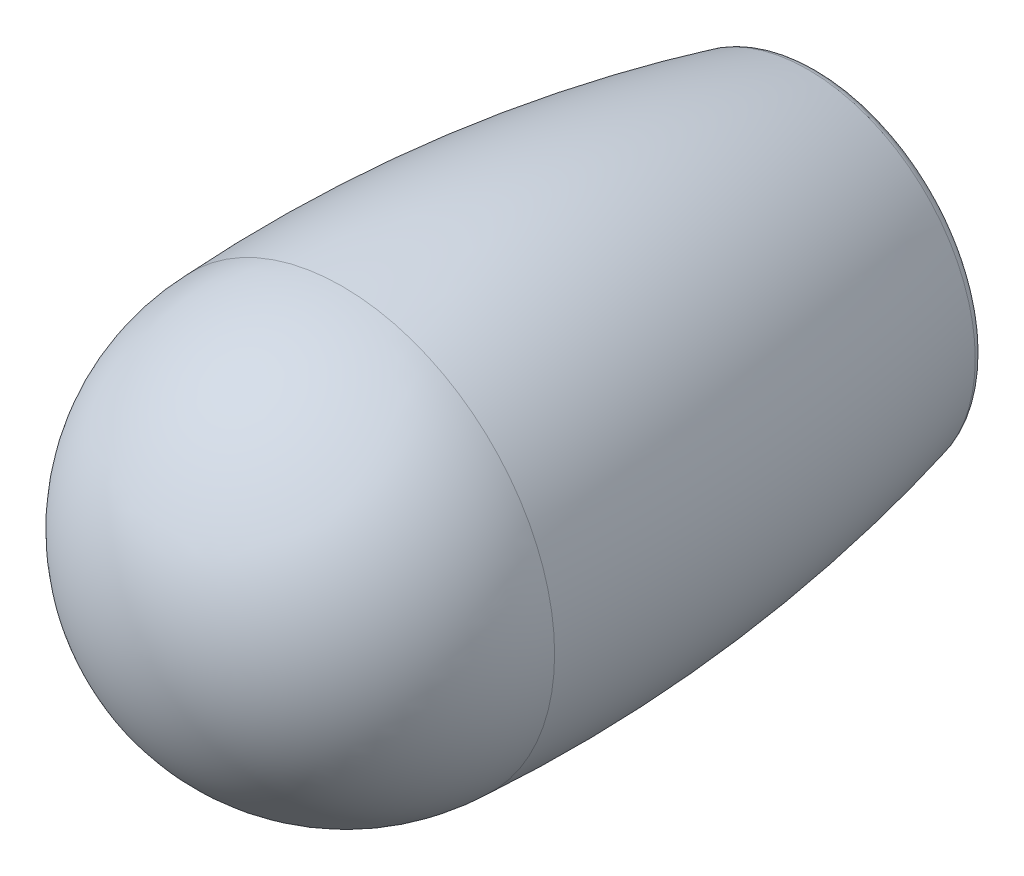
ISO-10303-21;
HEADER;
FILE_DESCRIPTION(('STEP AP214'),'2;1');
FILE_NAME('part.step','',(''),(''),'','','');
FILE_SCHEMA(('AUTOMOTIVE_DESIGN { 1 0 10303 214 1 1 1 1 }'));
ENDSEC;
DATA;
#1=APPLICATION_CONTEXT('core data for automotive mechanical design processes');
#2=APPLICATION_PROTOCOL_DEFINITION('international standard','automotive_design',2000,#1);
#3=PRODUCT_CONTEXT('',#1,'mechanical');
#4=PRODUCT('Part','Part','',(#3));
#5=PRODUCT_RELATED_PRODUCT_CATEGORY('part','',(#4));
#6=PRODUCT_DEFINITION_FORMATION('','',#4);
#7=PRODUCT_DEFINITION_CONTEXT('part definition',#1,'design');
#8=PRODUCT_DEFINITION('design','',#6,#7);
#9=PRODUCT_DEFINITION_SHAPE('','',#8);
#10=(LENGTH_UNIT() NAMED_UNIT(*) SI_UNIT(.MILLI.,.METRE.));
#11=(NAMED_UNIT(*) PLANE_ANGLE_UNIT() SI_UNIT($,.RADIAN.));
#12=(NAMED_UNIT(*) SI_UNIT($,.STERADIAN.) SOLID_ANGLE_UNIT());
#13=UNCERTAINTY_MEASURE_WITH_UNIT(LENGTH_MEASURE(1.E-05),#10,'distance_accuracy_value','');
#14=(GEOMETRIC_REPRESENTATION_CONTEXT(3) GLOBAL_UNCERTAINTY_ASSIGNED_CONTEXT((#13)) GLOBAL_UNIT_ASSIGNED_CONTEXT((#10,
#11,#12)) REPRESENTATION_CONTEXT('',''));
#15=CARTESIAN_POINT('',(0.,0.,0.));
#16=DIRECTION('',(0.,0.,1.));
#17=DIRECTION('',(1.,0.,0.));
#18=AXIS2_PLACEMENT_3D('',#15,#16,#17);
#19=CARTESIAN_POINT('',(0.,3.5,0.));
#20=DIRECTION('',(0.,0.,-1.));
#21=DIRECTION('',(0.,-1.,0.));
#22=AXIS2_PLACEMENT_3D('',#19,#20,#21);
#23=PLANE('',#22);
#24=CARTESIAN_POINT('',(0.,0.,0.));
#25=DIRECTION('',(0.,0.,1.));
#26=DIRECTION('',(0.,1.,0.));
#27=AXIS2_PLACEMENT_3D('',#24,#25,#26);
#28=CIRCLE('',#27,3.5);
#29=CARTESIAN_POINT('',(0.,3.5,0.));
#30=VERTEX_POINT('',#29);
#31=EDGE_CURVE('E8',#30,#30,#28,.T.);
#32=ORIENTED_EDGE('',*,*,#31,.T.);
#33=EDGE_LOOP('',(#32));
#34=FACE_BOUND('',#33,.T.);
#35=CARTESIAN_POINT('',(0.,0.,0.));
#36=DIRECTION('',(0.,0.,1.));
#37=DIRECTION('',(0.,1.,0.));
#38=AXIS2_PLACEMENT_3D('',#35,#36,#37);
#39=CIRCLE('',#38,5.61086622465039);
#40=CARTESIAN_POINT('',(0.,5.61086622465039,0.));
#41=VERTEX_POINT('',#40);
#42=EDGE_CURVE('E40',#41,#41,#39,.T.);
#43=ORIENTED_EDGE('',*,*,#42,.F.);
#44=EDGE_LOOP('',(#43));
#45=FACE_BOUND('',#44,.T.);
#46=ADVANCED_FACE('F12',(#34,#45),#23,.T.);
#47=CARTESIAN_POINT('',(0.,0.,30.));
#48=DIRECTION('',(0.,0.,1.));
#49=DIRECTION('',(0.,1.,0.));
#50=AXIS2_PLACEMENT_3D('',#47,#48,#49);
#51=CYLINDRICAL_SURFACE('',#50,3.5);
#52=CARTESIAN_POINT('',(0.,0.,4.));
#53=DIRECTION('',(0.,0.,1.));
#54=DIRECTION('',(0.,1.,0.));
#55=AXIS2_PLACEMENT_3D('',#52,#53,#54);
#56=CIRCLE('',#55,3.5);
#57=CARTESIAN_POINT('',(0.,3.5,4.));
#58=VERTEX_POINT('',#57);
#59=EDGE_CURVE('E18',#58,#58,#56,.T.);
#60=ORIENTED_EDGE('',*,*,#59,.T.);
#61=EDGE_LOOP('',(#60));
#62=FACE_BOUND('',#61,.T.);
#63=ORIENTED_EDGE('',*,*,#31,.F.);
#64=EDGE_LOOP('',(#63));
#65=FACE_BOUND('',#64,.T.);
#66=ADVANCED_FACE('F48',(#62,#65),#51,.F.);
#67=CARTESIAN_POINT('',(0.,3.5,4.));
#68=DIRECTION('',(0.,0.,-1.));
#69=DIRECTION('',(0.,-1.,0.));
#70=AXIS2_PLACEMENT_3D('',#67,#68,#69);
#71=PLANE('',#70);
#72=CARTESIAN_POINT('',(0.,0.,4.));
#73=DIRECTION('',(0.,0.,1.));
#74=DIRECTION('',(0.,1.,0.));
#75=AXIS2_PLACEMENT_3D('',#72,#73,#74);
#76=CIRCLE('',#75,3.);
#77=CARTESIAN_POINT('',(0.,3.,4.));
#78=VERTEX_POINT('',#77);
#79=EDGE_CURVE('E22',#78,#78,#76,.T.);
#80=ORIENTED_EDGE('',*,*,#79,.T.);
#81=EDGE_LOOP('',(#80));
#82=FACE_BOUND('',#81,.T.);
#83=ORIENTED_EDGE('',*,*,#59,.F.);
#84=EDGE_LOOP('',(#83));
#85=FACE_BOUND('',#84,.T.);
#86=ADVANCED_FACE('F54',(#82,#85),#71,.T.);
#87=CARTESIAN_POINT('',(0.,0.,30.));
#88=DIRECTION('',(0.,0.,1.));
#89=DIRECTION('',(0.,1.,0.));
#90=AXIS2_PLACEMENT_3D('',#87,#88,#89);
#91=CYLINDRICAL_SURFACE('',#90,3.);
#92=CARTESIAN_POINT('',(0.,0.,16.5));
#93=DIRECTION('',(0.,0.,1.));
#94=DIRECTION('',(0.,1.,0.));
#95=AXIS2_PLACEMENT_3D('',#92,#93,#94);
#96=CIRCLE('',#95,3.);
#97=CARTESIAN_POINT('',(0.,3.,16.5));
#98=VERTEX_POINT('',#97);
#99=EDGE_CURVE('E26',#98,#98,#96,.T.);
#100=ORIENTED_EDGE('',*,*,#99,.T.);
#101=EDGE_LOOP('',(#100));
#102=FACE_BOUND('',#101,.T.);
#103=ORIENTED_EDGE('',*,*,#79,.F.);
#104=EDGE_LOOP('',(#103));
#105=FACE_BOUND('',#104,.T.);
#106=ADVANCED_FACE('F59',(#102,#105),#91,.F.);
#107=CARTESIAN_POINT('',(0.,0.,16.5));
#108=DIRECTION('',(0.,0.,1.));
#109=DIRECTION('',(0.,1.,0.));
#110=AXIS2_PLACEMENT_3D('',#107,#108,#109);
#111=TOROIDAL_SURFACE('',#110,2.5,0.5);
#112=CARTESIAN_POINT('',(0.,0.,17.));
#113=DIRECTION('',(0.,0.,1.));
#114=DIRECTION('',(0.,1.,0.));
#115=AXIS2_PLACEMENT_3D('',#112,#113,#114);
#116=CIRCLE('',#115,2.5);
#117=CARTESIAN_POINT('',(0.,2.5,17.));
#118=VERTEX_POINT('',#117);
#119=EDGE_CURVE('E31',#118,#118,#116,.T.);
#120=ORIENTED_EDGE('',*,*,#119,.T.);
#121=EDGE_LOOP('',(#120));
#122=FACE_BOUND('',#121,.T.);
#123=ORIENTED_EDGE('',*,*,#99,.F.);
#124=EDGE_LOOP('',(#123));
#125=FACE_BOUND('',#124,.T.);
#126=ADVANCED_FACE('F66',(#122,#125),#111,.F.);
#127=CARTESIAN_POINT('',(0.,2.5,17.));
#128=DIRECTION('',(0.,0.,-1.));
#129=DIRECTION('',(0.,-1.,0.));
#130=AXIS2_PLACEMENT_3D('',#127,#128,#129);
#131=PLANE('',#130);
#132=ORIENTED_EDGE('',*,*,#119,.F.);
#133=EDGE_LOOP('',(#132));
#134=FACE_BOUND('',#133,.T.);
#135=ADVANCED_FACE('F70',(#134),#131,.T.);
#136=CARTESIAN_POINT('',(0.,0.,17.25));
#137=DIRECTION('',(0.,0.,1.));
#138=DIRECTION('',(0.,1.,0.));
#139=AXIS2_PLACEMENT_3D('',#136,#137,#138);
#140=SPHERICAL_SURFACE('',#139,7.75);
#141=CARTESIAN_POINT('',(0.,0.,17.3863121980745));
#142=DIRECTION('',(0.,0.,1.));
#143=DIRECTION('',(0.,1.,0.));
#144=AXIS2_PLACEMENT_3D('',#141,#142,#143);
#145=CIRCLE('',#144,7.74880113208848);
#146=CARTESIAN_POINT('',(0.,7.74880113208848,17.3863121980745));
#147=VERTEX_POINT('',#146);
#148=EDGE_CURVE('E34',#147,#147,#145,.T.);
#149=ORIENTED_EDGE('',*,*,#148,.T.);
#150=EDGE_LOOP('',(#149));
#151=FACE_BOUND('',#150,.T.);
#152=ADVANCED_FACE('F74',(#151),#140,.T.);
#153=CARTESIAN_POINT('',(0.,0.,14.4315556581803));
#154=DIRECTION('',(0.,0.,1.));
#155=DIRECTION('',(0.,1.,0.));
#156=AXIS2_PLACEMENT_3D('',#153,#154,#155);
#157=DEGENERATE_TOROIDAL_SURFACE('',#156,50.1758862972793,58.,.F.);
#158=CARTESIAN_POINT('',(0.,0.,0.378856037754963));
#159=DIRECTION('',(0.,0.,1.));
#160=DIRECTION('',(0.,1.,0.));
#161=AXIS2_PLACEMENT_3D('',#158,#159,#160);
#162=CIRCLE('',#161,6.09596842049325);
#163=CARTESIAN_POINT('',(0.,6.09596842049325,0.378856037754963));
#164=VERTEX_POINT('',#163);
#165=EDGE_CURVE('E37',#164,#164,#162,.T.);
#166=ORIENTED_EDGE('',*,*,#165,.T.);
#167=EDGE_LOOP('',(#166));
#168=FACE_BOUND('',#167,.T.);
#169=ORIENTED_EDGE('',*,*,#148,.F.);
#170=EDGE_LOOP('',(#169));
#171=FACE_BOUND('',#170,.T.);
#172=ADVANCED_FACE('F78',(#168,#171),#157,.F.);
#173=CARTESIAN_POINT('',(0.,0.,0.500000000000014));
#174=DIRECTION('',(0.,0.,1.));
#175=DIRECTION('',(0.,1.,0.));
#176=AXIS2_PLACEMENT_3D('',#173,#174,#175);
#177=TOROIDAL_SURFACE('',#176,5.61086622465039,0.5);
#178=ORIENTED_EDGE('',*,*,#42,.T.);
#179=EDGE_LOOP('',(#178));
#180=FACE_BOUND('',#179,.T.);
#181=ORIENTED_EDGE('',*,*,#165,.F.);
#182=EDGE_LOOP('',(#181));
#183=FACE_BOUND('',#182,.T.);
#184=ADVANCED_FACE('F44',(#180,#183),#177,.T.);
#185=CLOSED_SHELL('',(#46,#66,#86,#106,#126,#135,#152,#172,#184));
#186=MANIFOLD_SOLID_BREP('B1',#185);
#187=ADVANCED_BREP_SHAPE_REPRESENTATION('',(#18,#186),#14);
#188=SHAPE_DEFINITION_REPRESENTATION(#9,#187);
ENDSEC;
END-ISO-10303-21;
